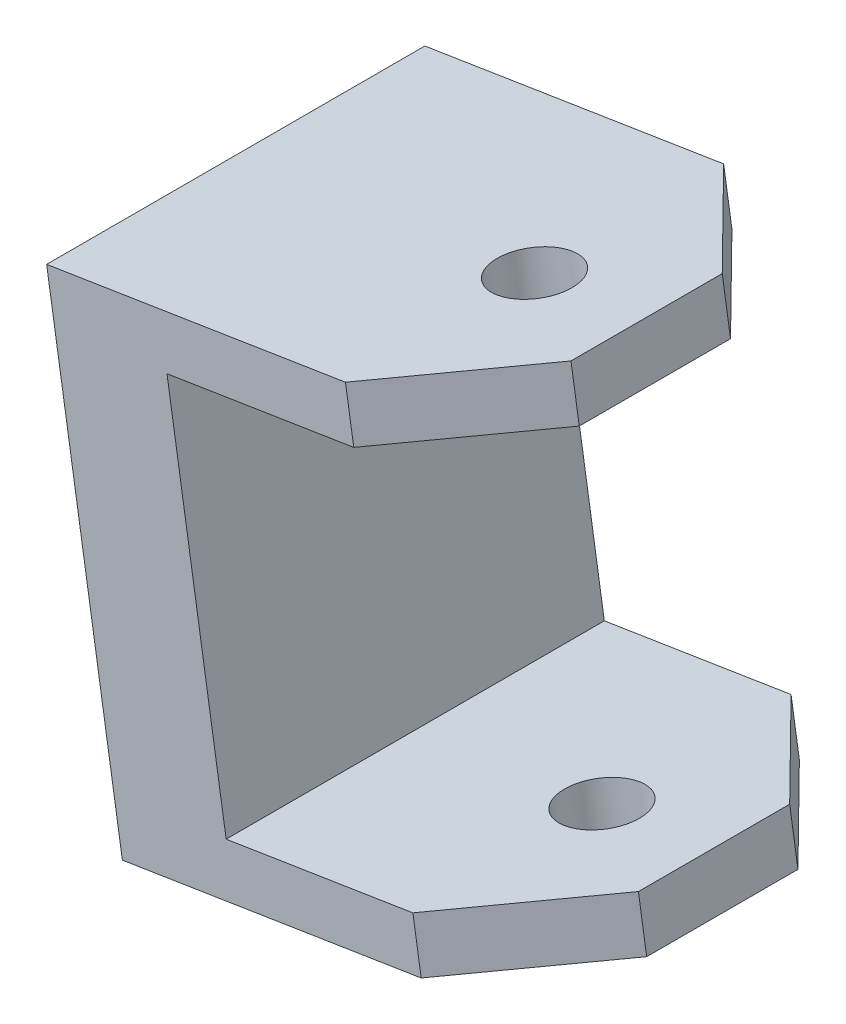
ISO-10303-21;
HEADER;
FILE_DESCRIPTION(('STEP AP214'),'2;1');
FILE_NAME('part.step','',(''),(''),'','','');
FILE_SCHEMA(('AUTOMOTIVE_DESIGN { 1 0 10303 214 1 1 1 1 }'));
ENDSEC;
DATA;
#1=APPLICATION_CONTEXT('core data for automotive mechanical design processes');
#2=APPLICATION_PROTOCOL_DEFINITION('international standard','automotive_design',2000,#1);
#3=PRODUCT_CONTEXT('',#1,'mechanical');
#4=PRODUCT('Part','Part','',(#3));
#5=PRODUCT_RELATED_PRODUCT_CATEGORY('part','',(#4));
#6=PRODUCT_DEFINITION_FORMATION('','',#4);
#7=PRODUCT_DEFINITION_CONTEXT('part definition',#1,'design');
#8=PRODUCT_DEFINITION('design','',#6,#7);
#9=PRODUCT_DEFINITION_SHAPE('','',#8);
#10=(LENGTH_UNIT() NAMED_UNIT(*) SI_UNIT(.MILLI.,.METRE.));
#11=(NAMED_UNIT(*) PLANE_ANGLE_UNIT() SI_UNIT($,.RADIAN.));
#12=(NAMED_UNIT(*) SI_UNIT($,.STERADIAN.) SOLID_ANGLE_UNIT());
#13=UNCERTAINTY_MEASURE_WITH_UNIT(LENGTH_MEASURE(1.E-05),#10,'distance_accuracy_value','');
#14=(GEOMETRIC_REPRESENTATION_CONTEXT(3) GLOBAL_UNCERTAINTY_ASSIGNED_CONTEXT((#13)) GLOBAL_UNIT_ASSIGNED_CONTEXT((#10,
#11,#12)) REPRESENTATION_CONTEXT('',''));
#15=CARTESIAN_POINT('',(0.,0.,0.));
#16=DIRECTION('',(0.,0.,1.));
#17=DIRECTION('',(1.,0.,0.));
#18=AXIS2_PLACEMENT_3D('',#15,#16,#17);
#19=CARTESIAN_POINT('',(285.498369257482,18.1365944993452,-25.));
#20=DIRECTION('',(-0.987688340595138,-0.156434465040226,0.));
#21=DIRECTION('',(0.156434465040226,-0.987688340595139,0.));
#22=AXIS2_PLACEMENT_3D('',#19,#20,#21);
#23=PLANE('',#22);
#24=DIRECTION('',(0.156434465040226,-0.987688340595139,0.));
#25=VECTOR('',#24,1.);
#26=CARTESIAN_POINT('',(285.498369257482,18.1365944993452,25.));
#27=LINE('',#26,#25);
#28=CARTESIAN_POINT('',(275.486563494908,81.348648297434,25.));
#29=VERTEX_POINT('',#28);
#30=CARTESIAN_POINT('',(285.498369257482,18.1365944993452,25.));
#31=VERTEX_POINT('',#30);
#32=EDGE_CURVE('E130',#29,#31,#27,.T.);
#33=ORIENTED_EDGE('',*,*,#32,.F.);
#34=DIRECTION('',(0.,0.,1.));
#35=VECTOR('',#34,1.);
#36=CARTESIAN_POINT('',(275.486563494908,81.348648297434,-25.));
#37=LINE('',#36,#35);
#38=CARTESIAN_POINT('',(275.486563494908,81.348648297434,-25.));
#39=VERTEX_POINT('',#38);
#40=EDGE_CURVE('E181',#39,#29,#37,.T.);
#41=ORIENTED_EDGE('',*,*,#40,.F.);
#42=DIRECTION('',(0.156434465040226,-0.987688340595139,0.));
#43=VECTOR('',#42,1.);
#44=CARTESIAN_POINT('',(285.498369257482,18.1365944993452,-25.));
#45=LINE('',#44,#43);
#46=CARTESIAN_POINT('',(285.498369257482,18.1365944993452,-25.));
#47=VERTEX_POINT('',#46);
#48=EDGE_CURVE('E132',#39,#47,#45,.T.);
#49=ORIENTED_EDGE('',*,*,#48,.T.);
#50=DIRECTION('',(0.,0.,1.));
#51=VECTOR('',#50,1.);
#52=CARTESIAN_POINT('',(285.498369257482,18.1365944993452,-25.));
#53=LINE('',#52,#51);
#54=EDGE_CURVE('E126',#47,#31,#53,.T.);
#55=ORIENTED_EDGE('',*,*,#54,.T.);
#56=EDGE_LOOP('',(#33,#41,#49,#55));
#57=FACE_BOUND('',#56,.T.);
#58=ADVANCED_FACE('F36',(#57),#23,.T.);
#59=CARTESIAN_POINT('',(275.486563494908,81.348648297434,-25.));
#60=DIRECTION('',(-0.156434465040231,0.987688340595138,0.));
#61=DIRECTION('',(-0.987688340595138,-0.156434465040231,0.));
#62=AXIS2_PLACEMENT_3D('',#59,#60,#61);
#63=PLANE('',#62);
#64=CARTESIAN_POINT('',(314.994097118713,87.6060268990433,0.));
#65=DIRECTION('',(-0.156434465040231,0.987688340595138,0.));
#66=DIRECTION('',(-0.987688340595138,-0.156434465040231,0.));
#67=AXIS2_PLACEMENT_3D('',#64,#65,#66);
#68=CIRCLE('',#67,5.00000000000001);
#69=CARTESIAN_POINT('',(310.055655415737,86.8238545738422,0.));
#70=VERTEX_POINT('',#69);
#71=EDGE_CURVE('E300',#70,#70,#68,.T.);
#72=ORIENTED_EDGE('',*,*,#71,.F.);
#73=EDGE_LOOP('',(#72));
#74=FACE_BOUND('',#73,.T.);
#75=DIRECTION('',(0.,0.,1.));
#76=VECTOR('',#75,1.);
#77=CARTESIAN_POINT('',(329.80942222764,89.9525438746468,-25.));
#78=LINE('',#77,#76);
#79=CARTESIAN_POINT('',(329.80942222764,89.9525438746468,-9.99999999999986));
#80=VERTEX_POINT('',#79);
#81=CARTESIAN_POINT('',(329.80942222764,89.9525438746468,9.9999999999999));
#82=VERTEX_POINT('',#81);
#83=EDGE_CURVE('E184',#80,#82,#78,.T.);
#84=ORIENTED_EDGE('',*,*,#83,.F.);
#85=DIRECTION('',(0.698401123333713,0.110615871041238,0.707106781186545));
#86=VECTOR('',#85,1.);
#87=CARTESIAN_POINT('',(295.24033030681,84.4773375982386,-44.9999999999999));
#88=LINE('',#87,#86);
#89=CARTESIAN_POINT('',(314.994097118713,87.6060268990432,-25.));
#90=VERTEX_POINT('',#89);
#91=EDGE_CURVE('E59',#80,#90,#88,.F.);
#92=ORIENTED_EDGE('',*,*,#91,.T.);
#93=DIRECTION('',(-0.987688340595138,-0.156434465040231,0.));
#94=VECTOR('',#93,1.);
#95=CARTESIAN_POINT('',(275.486563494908,81.348648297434,-25.));
#96=LINE('',#95,#94);
#97=EDGE_CURVE('E137',#90,#39,#96,.T.);
#98=ORIENTED_EDGE('',*,*,#97,.T.);
#99=ORIENTED_EDGE('',*,*,#40,.T.);
#100=DIRECTION('',(-0.987688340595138,-0.156434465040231,0.));
#101=VECTOR('',#100,1.);
#102=CARTESIAN_POINT('',(275.486563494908,81.348648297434,25.));
#103=LINE('',#102,#101);
#104=CARTESIAN_POINT('',(314.994097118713,87.6060268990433,25.));
#105=VERTEX_POINT('',#104);
#106=EDGE_CURVE('E152',#105,#29,#103,.T.);
#107=ORIENTED_EDGE('',*,*,#106,.F.);
#108=DIRECTION('',(0.698401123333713,0.110615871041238,-0.707106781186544));
#109=VECTOR('',#108,1.);
#110=CARTESIAN_POINT('',(319.932538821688,88.3881992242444,20.0000000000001));
#111=LINE('',#110,#109);
#112=EDGE_CURVE('E51',#105,#82,#111,.T.);
#113=ORIENTED_EDGE('',*,*,#112,.T.);
#114=EDGE_LOOP('',(#84,#92,#98,#99,#107,#113));
#115=FACE_BOUND('',#114,.T.);
#116=ADVANCED_FACE('F235',(#74,#115),#63,.T.);
#117=CARTESIAN_POINT('',(329.80942222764,89.9525438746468,-25.));
#118=DIRECTION('',(0.987688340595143,0.156434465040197,0.));
#119=DIRECTION('',(-0.156434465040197,0.987688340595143,0.));
#120=AXIS2_PLACEMENT_3D('',#117,#118,#119);
#121=PLANE('',#120);
#122=DIRECTION('',(0.,0.,1.));
#123=VECTOR('',#122,1.);
#124=CARTESIAN_POINT('',(330.904463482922,83.0387254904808,-25.));
#125=LINE('',#124,#123);
#126=CARTESIAN_POINT('',(330.904463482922,83.0387254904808,-9.99999999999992));
#127=VERTEX_POINT('',#126);
#128=CARTESIAN_POINT('',(330.904463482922,83.0387254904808,9.99999999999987));
#129=VERTEX_POINT('',#128);
#130=EDGE_CURVE('E186',#127,#129,#125,.T.);
#131=ORIENTED_EDGE('',*,*,#130,.F.);
#132=DIRECTION('',(-0.156434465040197,0.987688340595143,0.));
#133=VECTOR('',#132,1.);
#134=CARTESIAN_POINT('',(329.80942222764,89.9525438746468,-9.9999999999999));
#135=LINE('',#134,#133);
#136=EDGE_CURVE('E219',#127,#80,#135,.T.);
#137=ORIENTED_EDGE('',*,*,#136,.T.);
#138=ORIENTED_EDGE('',*,*,#83,.T.);
#139=DIRECTION('',(0.156434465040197,-0.987688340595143,0.));
#140=VECTOR('',#139,1.);
#141=CARTESIAN_POINT('',(330.904463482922,83.0387254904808,9.9999999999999));
#142=LINE('',#141,#140);
#143=EDGE_CURVE('E217',#82,#129,#142,.T.);
#144=ORIENTED_EDGE('',*,*,#143,.T.);
#145=EDGE_LOOP('',(#131,#137,#138,#144));
#146=FACE_BOUND('',#145,.T.);
#147=ADVANCED_FACE('F234',(#146),#121,.T.);
#148=CARTESIAN_POINT('',(330.904463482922,83.0387254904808,-25.));
#149=DIRECTION('',(0.156434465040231,-0.987688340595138,0.));
#150=DIRECTION('',(0.987688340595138,0.156434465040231,0.));
#151=AXIS2_PLACEMENT_3D('',#148,#149,#150);
#152=PLANE('',#151);
#153=CARTESIAN_POINT('',(316.089138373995,80.6922085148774,0.));
#154=DIRECTION('',(0.156434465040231,-0.987688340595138,0.));
#155=DIRECTION('',(0.987688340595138,0.156434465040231,0.));
#156=AXIS2_PLACEMENT_3D('',#153,#154,#155);
#157=CIRCLE('',#156,5.00000000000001);
#158=CARTESIAN_POINT('',(321.02758007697,81.4743808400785,0.));
#159=VERTEX_POINT('',#158);
#160=EDGE_CURVE('E154',#159,#159,#157,.T.);
#161=ORIENTED_EDGE('',*,*,#160,.F.);
#162=EDGE_LOOP('',(#161));
#163=FACE_BOUND('',#162,.T.);
#164=DIRECTION('',(0.987688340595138,0.156434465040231,0.));
#165=VECTOR('',#164,1.);
#166=CARTESIAN_POINT('',(330.904463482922,83.0387254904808,-25.));
#167=LINE('',#166,#165);
#168=CARTESIAN_POINT('',(291.396929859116,76.7813468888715,-25.));
#169=VERTEX_POINT('',#168);
#170=CARTESIAN_POINT('',(316.089138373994,80.6922085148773,-25.));
#171=VERTEX_POINT('',#170);
#172=EDGE_CURVE('E177',#169,#171,#167,.T.);
#173=ORIENTED_EDGE('',*,*,#172,.T.);
#174=DIRECTION('',(-0.698401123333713,-0.110615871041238,-0.707106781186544));
#175=VECTOR('',#174,1.);
#176=CARTESIAN_POINT('',(323.496800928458,81.8654670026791,-17.4999999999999));
#177=LINE('',#176,#175);
#178=EDGE_CURVE('E11',#171,#127,#177,.F.);
#179=ORIENTED_EDGE('',*,*,#178,.T.);
#180=ORIENTED_EDGE('',*,*,#130,.T.);
#181=DIRECTION('',(-0.698401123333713,-0.110615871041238,0.707106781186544));
#182=VECTOR('',#181,1.);
#183=CARTESIAN_POINT('',(348.189009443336,85.7763286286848,-7.4999999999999));
#184=LINE('',#183,#182);
#185=CARTESIAN_POINT('',(316.089138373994,80.6922085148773,25.));
#186=VERTEX_POINT('',#185);
#187=EDGE_CURVE('E44',#129,#186,#184,.T.);
#188=ORIENTED_EDGE('',*,*,#187,.T.);
#189=DIRECTION('',(0.987688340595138,0.156434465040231,0.));
#190=VECTOR('',#189,1.);
#191=CARTESIAN_POINT('',(330.904463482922,83.0387254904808,25.));
#192=LINE('',#191,#190);
#193=CARTESIAN_POINT('',(291.396929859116,76.7813468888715,25.));
#194=VERTEX_POINT('',#193);
#195=EDGE_CURVE('E165',#194,#186,#192,.T.);
#196=ORIENTED_EDGE('',*,*,#195,.F.);
#197=DIRECTION('',(0.,0.,1.));
#198=VECTOR('',#197,1.);
#199=CARTESIAN_POINT('',(291.396929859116,76.7813468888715,-25.));
#200=LINE('',#199,#198);
#201=EDGE_CURVE('E189',#169,#194,#200,.T.);
#202=ORIENTED_EDGE('',*,*,#201,.F.);
#203=EDGE_LOOP('',(#173,#179,#180,#188,#196,#202));
#204=FACE_BOUND('',#203,.T.);
#205=ADVANCED_FACE('F226',(#163,#204),#152,.T.);
#206=CARTESIAN_POINT('',(291.396929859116,76.7813468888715,-25.));
#207=DIRECTION('',(0.987688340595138,0.156434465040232,0.));
#208=DIRECTION('',(-0.156434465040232,0.987688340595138,0.));
#209=AXIS2_PLACEMENT_3D('',#206,#207,#208);
#210=PLANE('',#209);
#211=DIRECTION('',(-0.156434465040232,0.987688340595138,0.));
#212=VECTOR('',#211,1.);
#213=CARTESIAN_POINT('',(291.396929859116,76.7813468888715,25.));
#214=LINE('',#213,#212);
#215=CARTESIAN_POINT('',(299.218653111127,27.3969298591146,25.));
#216=VERTEX_POINT('',#215);
#217=EDGE_CURVE('E162',#216,#194,#214,.T.);
#218=ORIENTED_EDGE('',*,*,#217,.F.);
#219=DIRECTION('',(0.,0.,1.));
#220=VECTOR('',#219,1.);
#221=CARTESIAN_POINT('',(299.218653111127,27.3969298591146,-25.));
#222=LINE('',#221,#220);
#223=CARTESIAN_POINT('',(299.218653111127,27.3969298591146,-25.));
#224=VERTEX_POINT('',#223);
#225=EDGE_CURVE('E191',#224,#216,#222,.T.);
#226=ORIENTED_EDGE('',*,*,#225,.F.);
#227=DIRECTION('',(-0.156434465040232,0.987688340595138,0.));
#228=VECTOR('',#227,1.);
#229=CARTESIAN_POINT('',(291.396929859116,76.7813468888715,-25.));
#230=LINE('',#229,#228);
#231=EDGE_CURVE('E174',#224,#169,#230,.T.);
#232=ORIENTED_EDGE('',*,*,#231,.T.);
#233=ORIENTED_EDGE('',*,*,#201,.T.);
#234=EDGE_LOOP('',(#218,#226,#232,#233));
#235=FACE_BOUND('',#234,.T.);
#236=ADVANCED_FACE('F246',(#235),#210,.T.);
#237=CARTESIAN_POINT('',(299.218653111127,27.3969298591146,-25.));
#238=DIRECTION('',(-0.156434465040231,0.987688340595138,0.));
#239=DIRECTION('',(-0.987688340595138,-0.156434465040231,0.));
#240=AXIS2_PLACEMENT_3D('',#237,#238,#239);
#241=PLANE('',#240);
#242=CARTESIAN_POINT('',(323.910861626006,31.3077914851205,0.));
#243=DIRECTION('',(-0.156434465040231,0.987688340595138,0.));
#244=DIRECTION('',(-0.987688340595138,-0.156434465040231,0.));
#245=AXIS2_PLACEMENT_3D('',#242,#243,#244);
#246=CIRCLE('',#245,5.00000000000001);
#247=CARTESIAN_POINT('',(318.972419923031,30.5256191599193,0.));
#248=VERTEX_POINT('',#247);
#249=EDGE_CURVE('E157',#248,#248,#246,.T.);
#250=ORIENTED_EDGE('',*,*,#249,.F.);
#251=EDGE_LOOP('',(#250));
#252=FACE_BOUND('',#251,.T.);
#253=DIRECTION('',(-0.987688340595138,-0.156434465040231,0.));
#254=VECTOR('',#253,1.);
#255=CARTESIAN_POINT('',(299.218653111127,27.3969298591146,25.));
#256=LINE('',#255,#254);
#257=CARTESIAN_POINT('',(323.910861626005,31.3077914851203,25.));
#258=VERTEX_POINT('',#257);
#259=EDGE_CURVE('E148',#258,#216,#256,.T.);
#260=ORIENTED_EDGE('',*,*,#259,.F.);
#261=DIRECTION('',(0.698401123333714,0.110615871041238,-0.707106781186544));
#262=VECTOR('',#261,1.);
#263=CARTESIAN_POINT('',(336.256965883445,33.2632222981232,12.5000000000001));
#264=LINE('',#263,#262);
#265=CARTESIAN_POINT('',(338.726186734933,33.6543084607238,9.9999999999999));
#266=VERTEX_POINT('',#265);
#267=EDGE_CURVE('E203',#258,#266,#264,.T.);
#268=ORIENTED_EDGE('',*,*,#267,.T.);
#269=DIRECTION('',(0.,0.,1.));
#270=VECTOR('',#269,1.);
#271=CARTESIAN_POINT('',(338.726186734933,33.6543084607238,-25.));
#272=LINE('',#271,#270);
#273=CARTESIAN_POINT('',(338.726186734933,33.6543084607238,-9.99999999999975));
#274=VERTEX_POINT('',#273);
#275=EDGE_CURVE('E194',#274,#266,#272,.T.);
#276=ORIENTED_EDGE('',*,*,#275,.F.);
#277=DIRECTION('',(0.698401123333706,0.110615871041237,0.707106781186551));
#278=VECTOR('',#277,1.);
#279=CARTESIAN_POINT('',(311.564757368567,29.3523606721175,-37.4999999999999));
#280=LINE('',#279,#278);
#281=CARTESIAN_POINT('',(323.910861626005,31.3077914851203,-25.));
#282=VERTEX_POINT('',#281);
#283=EDGE_CURVE('E201',#274,#282,#280,.F.);
#284=ORIENTED_EDGE('',*,*,#283,.T.);
#285=DIRECTION('',(-0.987688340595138,-0.156434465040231,0.));
#286=VECTOR('',#285,1.);
#287=CARTESIAN_POINT('',(299.218653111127,27.3969298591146,-25.));
#288=LINE('',#287,#286);
#289=EDGE_CURVE('E172',#282,#224,#288,.T.);
#290=ORIENTED_EDGE('',*,*,#289,.T.);
#291=ORIENTED_EDGE('',*,*,#225,.T.);
#292=EDGE_LOOP('',(#260,#268,#276,#284,#290,#291));
#293=FACE_BOUND('',#292,.T.);
#294=ADVANCED_FACE('F249',(#252,#293),#241,.T.);
#295=CARTESIAN_POINT('',(338.726186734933,33.6543084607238,-25.));
#296=DIRECTION('',(0.98768834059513,0.156434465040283,0.));
#297=DIRECTION('',(-0.156434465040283,0.98768834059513,0.));
#298=AXIS2_PLACEMENT_3D('',#295,#296,#297);
#299=PLANE('',#298);
#300=ORIENTED_EDGE('',*,*,#275,.T.);
#301=DIRECTION('',(0.156434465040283,-0.98768834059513,0.));
#302=VECTOR('',#301,1.);
#303=CARTESIAN_POINT('',(339.821227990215,26.7404900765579,9.9999999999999));
#304=LINE('',#303,#302);
#305=CARTESIAN_POINT('',(339.821227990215,26.7404900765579,9.99999999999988));
#306=VERTEX_POINT('',#305);
#307=EDGE_CURVE('E208',#266,#306,#304,.T.);
#308=ORIENTED_EDGE('',*,*,#307,.T.);
#309=DIRECTION('',(0.,0.,1.));
#310=VECTOR('',#309,1.);
#311=CARTESIAN_POINT('',(339.821227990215,26.7404900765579,-25.));
#312=LINE('',#311,#310);
#313=CARTESIAN_POINT('',(339.821227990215,26.7404900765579,-9.99999999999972));
#314=VERTEX_POINT('',#313);
#315=EDGE_CURVE('E136',#314,#306,#312,.T.);
#316=ORIENTED_EDGE('',*,*,#315,.F.);
#317=DIRECTION('',(-0.156434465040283,0.98768834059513,0.));
#318=VECTOR('',#317,1.);
#319=CARTESIAN_POINT('',(338.726186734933,33.6543084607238,-9.99999999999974));
#320=LINE('',#319,#318);
#321=EDGE_CURVE('E205',#314,#274,#320,.T.);
#322=ORIENTED_EDGE('',*,*,#321,.T.);
#323=EDGE_LOOP('',(#300,#308,#316,#322));
#324=FACE_BOUND('',#323,.T.);
#325=ADVANCED_FACE('F258',(#324),#299,.T.);
#326=CARTESIAN_POINT('',(339.821227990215,26.7404900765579,-25.));
#327=DIRECTION('',(0.156434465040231,-0.987688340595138,0.));
#328=DIRECTION('',(0.987688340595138,0.156434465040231,0.));
#329=AXIS2_PLACEMENT_3D('',#326,#327,#328);
#330=PLANE('',#329);
#331=CARTESIAN_POINT('',(325.005902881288,24.3939731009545,0.));
#332=DIRECTION('',(0.156434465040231,-0.987688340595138,0.));
#333=DIRECTION('',(0.987688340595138,0.156434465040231,0.));
#334=AXIS2_PLACEMENT_3D('',#331,#332,#333);
#335=CIRCLE('',#334,5.00000000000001);
#336=CARTESIAN_POINT('',(329.944344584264,25.1761454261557,0.));
#337=VERTEX_POINT('',#336);
#338=EDGE_CURVE('E39',#337,#337,#335,.T.);
#339=ORIENTED_EDGE('',*,*,#338,.F.);
#340=EDGE_LOOP('',(#339));
#341=FACE_BOUND('',#340,.T.);
#342=ORIENTED_EDGE('',*,*,#315,.T.);
#343=DIRECTION('',(-0.698401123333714,-0.110615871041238,0.707106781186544));
#344=VECTOR('',#343,1.);
#345=CARTESIAN_POINT('',(357.105773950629,29.478093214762,-7.49999999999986));
#346=LINE('',#345,#344);
#347=CARTESIAN_POINT('',(325.005902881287,24.3939731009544,25.));
#348=VERTEX_POINT('',#347);
#349=EDGE_CURVE('E144',#306,#348,#346,.T.);
#350=ORIENTED_EDGE('',*,*,#349,.T.);
#351=DIRECTION('',(0.987688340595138,0.156434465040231,0.));
#352=VECTOR('',#351,1.);
#353=CARTESIAN_POINT('',(339.821227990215,26.7404900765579,25.));
#354=LINE('',#353,#352);
#355=EDGE_CURVE('E140',#31,#348,#354,.T.);
#356=ORIENTED_EDGE('',*,*,#355,.F.);
#357=ORIENTED_EDGE('',*,*,#54,.F.);
#358=DIRECTION('',(0.987688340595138,0.156434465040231,0.));
#359=VECTOR('',#358,1.);
#360=CARTESIAN_POINT('',(339.821227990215,26.7404900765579,-25.));
#361=LINE('',#360,#359);
#362=CARTESIAN_POINT('',(325.005902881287,24.3939731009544,-25.));
#363=VERTEX_POINT('',#362);
#364=EDGE_CURVE('E170',#47,#363,#361,.T.);
#365=ORIENTED_EDGE('',*,*,#364,.T.);
#366=DIRECTION('',(-0.698401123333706,-0.110615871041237,-0.707106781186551));
#367=VECTOR('',#366,1.);
#368=CARTESIAN_POINT('',(332.413565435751,25.5672315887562,-17.5));
#369=LINE('',#368,#367);
#370=EDGE_CURVE('E210',#363,#314,#369,.F.);
#371=ORIENTED_EDGE('',*,*,#370,.T.);
#372=EDGE_LOOP('',(#342,#350,#356,#357,#365,#371));
#373=FACE_BOUND('',#372,.T.);
#374=ADVANCED_FACE('F142',(#341,#373),#330,.T.);
#375=CARTESIAN_POINT('',(275.486563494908,81.348648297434,-25.));
#376=DIRECTION('',(0.,0.,-1.));
#377=DIRECTION('',(-1.,0.,0.));
#378=AXIS2_PLACEMENT_3D('',#375,#376,#377);
#379=PLANE('',#378);
#380=ORIENTED_EDGE('',*,*,#289,.F.);
#381=DIRECTION('',(0.156434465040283,-0.98768834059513,0.));
#382=VECTOR('',#381,1.);
#383=CARTESIAN_POINT('',(314.994097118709,87.6060268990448,-25.));
#384=LINE('',#383,#382);
#385=EDGE_CURVE('E215',#282,#363,#384,.T.);
#386=ORIENTED_EDGE('',*,*,#385,.T.);
#387=ORIENTED_EDGE('',*,*,#364,.F.);
#388=ORIENTED_EDGE('',*,*,#48,.F.);
#389=ORIENTED_EDGE('',*,*,#97,.F.);
#390=DIRECTION('',(0.156434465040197,-0.987688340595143,0.));
#391=VECTOR('',#390,1.);
#392=CARTESIAN_POINT('',(314.994097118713,87.6060268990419,-25.));
#393=LINE('',#392,#391);
#394=EDGE_CURVE('E213',#90,#171,#393,.T.);
#395=ORIENTED_EDGE('',*,*,#394,.T.);
#396=ORIENTED_EDGE('',*,*,#172,.F.);
#397=ORIENTED_EDGE('',*,*,#231,.F.);
#398=EDGE_LOOP('',(#380,#386,#387,#388,#389,#395,#396,#397));
#399=FACE_BOUND('',#398,.T.);
#400=ADVANCED_FACE('F239',(#399),#379,.T.);
#401=CARTESIAN_POINT('',(275.486563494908,81.348648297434,25.));
#402=DIRECTION('',(0.,0.,-1.));
#403=DIRECTION('',(-1.,0.,0.));
#404=AXIS2_PLACEMENT_3D('',#401,#402,#403);
#405=PLANE('',#404);
#406=ORIENTED_EDGE('',*,*,#355,.T.);
#407=DIRECTION('',(-0.156434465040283,0.98768834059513,0.));
#408=VECTOR('',#407,1.);
#409=CARTESIAN_POINT('',(323.910861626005,31.3077914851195,25.));
#410=LINE('',#409,#408);
#411=EDGE_CURVE('E199',#348,#258,#410,.T.);
#412=ORIENTED_EDGE('',*,*,#411,.T.);
#413=ORIENTED_EDGE('',*,*,#259,.T.);
#414=ORIENTED_EDGE('',*,*,#217,.T.);
#415=ORIENTED_EDGE('',*,*,#195,.T.);
#416=DIRECTION('',(-0.156434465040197,0.987688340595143,0.));
#417=VECTOR('',#416,1.);
#418=CARTESIAN_POINT('',(314.994097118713,87.6060268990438,25.));
#419=LINE('',#418,#417);
#420=EDGE_CURVE('E183',#186,#105,#419,.T.);
#421=ORIENTED_EDGE('',*,*,#420,.T.);
#422=ORIENTED_EDGE('',*,*,#106,.T.);
#423=ORIENTED_EDGE('',*,*,#32,.T.);
#424=EDGE_LOOP('',(#406,#412,#413,#414,#415,#421,#422,#423));
#425=FACE_BOUND('',#424,.T.);
#426=ADVANCED_FACE('F150',(#425),#405,.F.);
#427=CARTESIAN_POINT('',(314.994097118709,87.6060268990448,25.));
#428=DIRECTION('',(0.698401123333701,0.110615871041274,0.707106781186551));
#429=DIRECTION('',(0.711472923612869,0.,-0.702713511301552));
#430=AXIS2_PLACEMENT_3D('',#427,#428,#429);
#431=PLANE('',#430);
#432=ORIENTED_EDGE('',*,*,#349,.F.);
#433=ORIENTED_EDGE('',*,*,#307,.F.);
#434=ORIENTED_EDGE('',*,*,#267,.F.);
#435=ORIENTED_EDGE('',*,*,#411,.F.);
#436=EDGE_LOOP('',(#432,#433,#434,#435));
#437=FACE_BOUND('',#436,.T.);
#438=ADVANCED_FACE('F261',(#437),#431,.T.);
#439=CARTESIAN_POINT('',(338.726186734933,33.6543084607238,-9.99999999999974));
#440=DIRECTION('',(-0.698401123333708,-0.110615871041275,0.707106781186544));
#441=DIRECTION('',(0.711472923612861,0.,0.70271351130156));
#442=AXIS2_PLACEMENT_3D('',#439,#440,#441);
#443=PLANE('',#442);
#444=ORIENTED_EDGE('',*,*,#370,.F.);
#445=ORIENTED_EDGE('',*,*,#385,.F.);
#446=ORIENTED_EDGE('',*,*,#283,.F.);
#447=ORIENTED_EDGE('',*,*,#321,.F.);
#448=EDGE_LOOP('',(#444,#445,#446,#447));
#449=FACE_BOUND('',#448,.T.);
#450=ADVANCED_FACE('F254',(#449),#443,.F.);
#451=CARTESIAN_POINT('',(329.80942222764,89.9525438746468,-9.9999999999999));
#452=DIRECTION('',(-0.698401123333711,-0.110615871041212,0.707106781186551));
#453=DIRECTION('',(0.711472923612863,0.,0.702713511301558));
#454=AXIS2_PLACEMENT_3D('',#451,#452,#453);
#455=PLANE('',#454);
#456=ORIENTED_EDGE('',*,*,#178,.F.);
#457=ORIENTED_EDGE('',*,*,#394,.F.);
#458=ORIENTED_EDGE('',*,*,#91,.F.);
#459=ORIENTED_EDGE('',*,*,#136,.F.);
#460=EDGE_LOOP('',(#456,#457,#458,#459));
#461=FACE_BOUND('',#460,.T.);
#462=ADVANCED_FACE('F242',(#461),#455,.F.);
#463=CARTESIAN_POINT('',(314.994097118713,87.6060268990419,25.));
#464=DIRECTION('',(0.698401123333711,0.110615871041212,0.707106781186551));
#465=DIRECTION('',(0.711472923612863,0.,-0.702713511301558));
#466=AXIS2_PLACEMENT_3D('',#463,#464,#465);
#467=PLANE('',#466);
#468=ORIENTED_EDGE('',*,*,#187,.F.);
#469=ORIENTED_EDGE('',*,*,#143,.F.);
#470=ORIENTED_EDGE('',*,*,#112,.F.);
#471=ORIENTED_EDGE('',*,*,#420,.F.);
#472=EDGE_LOOP('',(#468,#469,#470,#471));
#473=FACE_BOUND('',#472,.T.);
#474=ADVANCED_FACE('F232',(#473),#467,.T.);
#475=CARTESIAN_POINT('',(326.335277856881,16.0006298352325,0.));
#476=DIRECTION('',(-0.156434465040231,0.987688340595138,0.));
#477=DIRECTION('',(-0.987688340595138,-0.156434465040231,0.));
#478=AXIS2_PLACEMENT_3D('',#475,#476,#477);
#479=CYLINDRICAL_SURFACE('',#478,5.00000000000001);
#480=ORIENTED_EDGE('',*,*,#249,.T.);
#481=EDGE_LOOP('',(#480));
#482=FACE_BOUND('',#481,.T.);
#483=ORIENTED_EDGE('',*,*,#338,.T.);
#484=EDGE_LOOP('',(#483));
#485=FACE_BOUND('',#484,.T.);
#486=ADVANCED_FACE('F307',(#482,#485),#479,.F.);
#487=ORIENTED_EDGE('',*,*,#160,.T.);
#488=EDGE_LOOP('',(#487));
#489=FACE_BOUND('',#488,.T.);
#490=ORIENTED_EDGE('',*,*,#71,.T.);
#491=EDGE_LOOP('',(#490));
#492=FACE_BOUND('',#491,.T.);
#493=ADVANCED_FACE('F305',(#489,#492),#479,.F.);
#494=CLOSED_SHELL('',(#58,#116,#147,#205,#236,#294,#325,#374,#400,#426,#438,#450,#462,#474,#486,#493));
#495=MANIFOLD_SOLID_BREP('B2',#494);
#496=ADVANCED_BREP_SHAPE_REPRESENTATION('',(#18,#495),#14);
#497=SHAPE_DEFINITION_REPRESENTATION(#9,#496);
ENDSEC;
END-ISO-10303-21;
